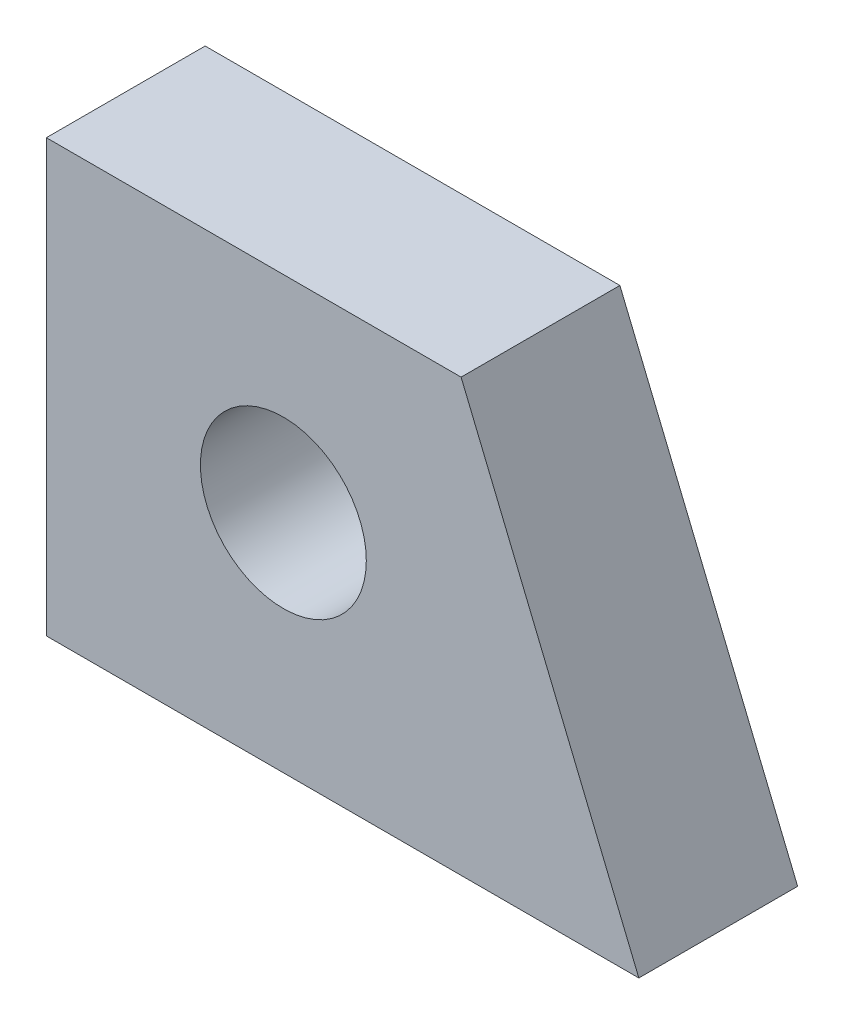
from build123d import *

# Parameters (mm, degrees)
ESQUISSE1_R          = 14
BASE_EXTRUSION_DEPTH = 26.8


with BuildPart() as part:
    # Esquisse1 → Base-Extrusion (new body)
    with BuildSketch(Plane.XY):
        Polygon((20, 8.721314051), (120, 8.721314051), (90, 81.551314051), (20, 81.551314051), align=None)
        with Locations((60, 46.721314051)):
            Circle(ESQUISSE1_R, mode=Mode.SUBTRACT)
    extrude(amount=BASE_EXTRUSION_DEPTH)


solid = part.part
